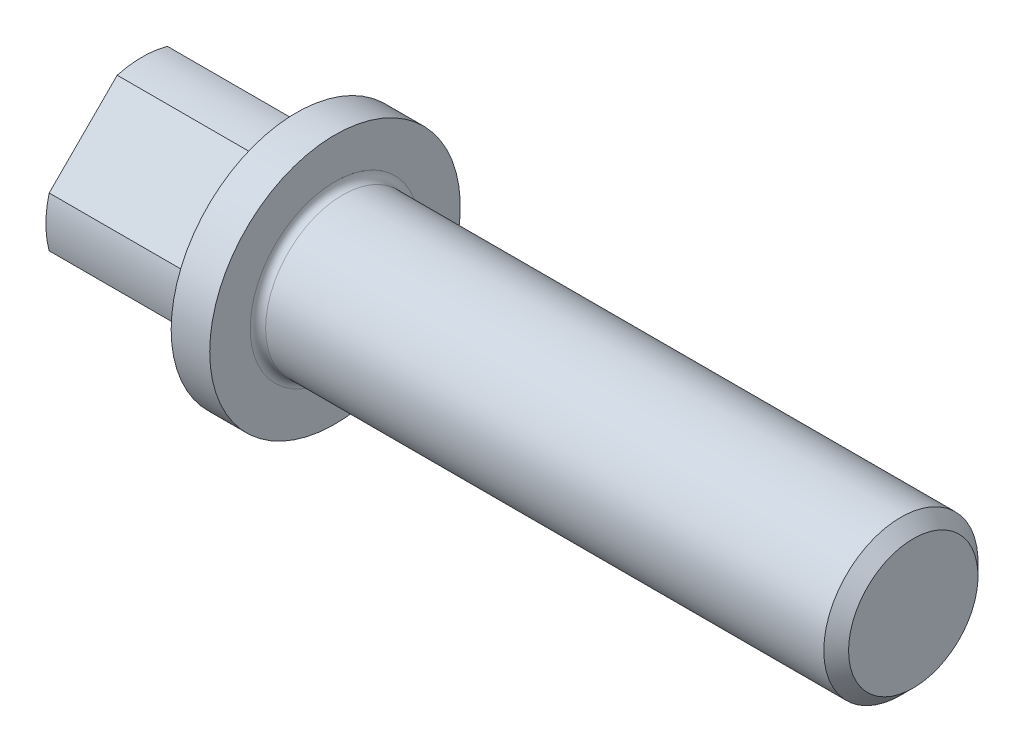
ISO-10303-21;
HEADER;
FILE_DESCRIPTION(('STEP AP214'),'2;1');
FILE_NAME('part.step','',(''),(''),'','','');
FILE_SCHEMA(('AUTOMOTIVE_DESIGN { 1 0 10303 214 1 1 1 1 }'));
ENDSEC;
DATA;
#1=APPLICATION_CONTEXT('core data for automotive mechanical design processes');
#2=APPLICATION_PROTOCOL_DEFINITION('international standard','automotive_design',2000,#1);
#3=PRODUCT_CONTEXT('',#1,'mechanical');
#4=PRODUCT('Part','Part','',(#3));
#5=PRODUCT_RELATED_PRODUCT_CATEGORY('part','',(#4));
#6=PRODUCT_DEFINITION_FORMATION('','',#4);
#7=PRODUCT_DEFINITION_CONTEXT('part definition',#1,'design');
#8=PRODUCT_DEFINITION('design','',#6,#7);
#9=PRODUCT_DEFINITION_SHAPE('','',#8);
#10=(LENGTH_UNIT() NAMED_UNIT(*) SI_UNIT(.MILLI.,.METRE.));
#11=(NAMED_UNIT(*) PLANE_ANGLE_UNIT() SI_UNIT($,.RADIAN.));
#12=(NAMED_UNIT(*) SI_UNIT($,.STERADIAN.) SOLID_ANGLE_UNIT());
#13=UNCERTAINTY_MEASURE_WITH_UNIT(LENGTH_MEASURE(1.E-05),#10,'distance_accuracy_value','');
#14=(GEOMETRIC_REPRESENTATION_CONTEXT(3) GLOBAL_UNCERTAINTY_ASSIGNED_CONTEXT((#13)) GLOBAL_UNIT_ASSIGNED_CONTEXT((#10,
#11,#12)) REPRESENTATION_CONTEXT('',''));
#15=CARTESIAN_POINT('',(0.,0.,0.));
#16=DIRECTION('',(0.,0.,1.));
#17=DIRECTION('',(1.,0.,0.));
#18=AXIS2_PLACEMENT_3D('',#15,#16,#17);
#19=CARTESIAN_POINT('',(60.,5.036,0.));
#20=DIRECTION('',(1.,0.,0.));
#21=DIRECTION('',(0.,0.,-1.));
#22=AXIS2_PLACEMENT_3D('',#19,#20,#21);
#23=PLANE('',#22);
#24=CARTESIAN_POINT('',(60.,0.,0.));
#25=DIRECTION('',(-1.,0.,0.));
#26=DIRECTION('',(0.,0.,1.));
#27=AXIS2_PLACEMENT_3D('',#24,#25,#26);
#28=CIRCLE('',#27,5.036);
#29=CARTESIAN_POINT('',(60.,0.,5.036));
#30=VERTEX_POINT('',#29);
#31=EDGE_CURVE('E171',#30,#30,#28,.T.);
#32=ORIENTED_EDGE('',*,*,#31,.F.);
#33=EDGE_LOOP('',(#32));
#34=FACE_BOUND('',#33,.T.);
#35=ADVANCED_FACE('F34',(#34),#23,.T.);
#36=CARTESIAN_POINT('',(60.,0.,0.));
#37=DIRECTION('',(-1.,0.,0.));
#38=DIRECTION('',(0.,0.,1.));
#39=AXIS2_PLACEMENT_3D('',#36,#37,#38);
#40=CONICAL_SURFACE('',#39,5.036,0.785398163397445);
#41=CARTESIAN_POINT('',(59.036,0.,0.));
#42=DIRECTION('',(-1.,0.,0.));
#43=DIRECTION('',(0.,0.,1.));
#44=AXIS2_PLACEMENT_3D('',#41,#42,#43);
#45=CIRCLE('',#44,6.);
#46=CARTESIAN_POINT('',(59.036,0.,6.));
#47=VERTEX_POINT('',#46);
#48=EDGE_CURVE('E168',#47,#47,#45,.T.);
#49=ORIENTED_EDGE('',*,*,#48,.F.);
#50=EDGE_LOOP('',(#49));
#51=FACE_BOUND('',#50,.T.);
#52=ORIENTED_EDGE('',*,*,#31,.T.);
#53=EDGE_LOOP('',(#52));
#54=FACE_BOUND('',#53,.T.);
#55=ADVANCED_FACE('F193',(#51,#54),#40,.T.);
#56=CARTESIAN_POINT('',(-31.75,0.,0.));
#57=DIRECTION('',(-1.,0.,0.));
#58=DIRECTION('',(0.,0.,1.));
#59=AXIS2_PLACEMENT_3D('',#56,#57,#58);
#60=CYLINDRICAL_SURFACE('',#59,6.);
#61=CARTESIAN_POINT('',(15.6,0.,0.));
#62=DIRECTION('',(1.,0.,0.));
#63=DIRECTION('',(0.,0.,-1.));
#64=AXIS2_PLACEMENT_3D('',#61,#62,#63);
#65=CIRCLE('',#64,6.);
#66=CARTESIAN_POINT('',(15.6,0.,-6.));
#67=VERTEX_POINT('',#66);
#68=EDGE_CURVE('E12',#67,#67,#65,.T.);
#69=ORIENTED_EDGE('',*,*,#68,.T.);
#70=EDGE_LOOP('',(#69));
#71=FACE_BOUND('',#70,.T.);
#72=ORIENTED_EDGE('',*,*,#48,.T.);
#73=EDGE_LOOP('',(#72));
#74=FACE_BOUND('',#73,.T.);
#75=ADVANCED_FACE('F198',(#71,#74),#60,.T.);
#76=CARTESIAN_POINT('',(15.,9.75,0.));
#77=DIRECTION('',(1.,0.,0.));
#78=DIRECTION('',(0.,0.,-1.));
#79=AXIS2_PLACEMENT_3D('',#76,#77,#78);
#80=PLANE('',#79);
#81=CARTESIAN_POINT('',(15.,0.,0.));
#82=DIRECTION('',(1.,0.,0.));
#83=DIRECTION('',(0.,0.,-1.));
#84=AXIS2_PLACEMENT_3D('',#81,#82,#83);
#85=CIRCLE('',#84,6.6);
#86=CARTESIAN_POINT('',(15.,0.,-6.6));
#87=VERTEX_POINT('',#86);
#88=EDGE_CURVE('E43',#87,#87,#85,.F.);
#89=ORIENTED_EDGE('',*,*,#88,.T.);
#90=EDGE_LOOP('',(#89));
#91=FACE_BOUND('',#90,.T.);
#92=CARTESIAN_POINT('',(15.,0.,0.));
#93=DIRECTION('',(-1.,0.,0.));
#94=DIRECTION('',(0.,0.,1.));
#95=AXIS2_PLACEMENT_3D('',#92,#93,#94);
#96=CIRCLE('',#95,9.75);
#97=CARTESIAN_POINT('',(15.,0.,9.75));
#98=VERTEX_POINT('',#97);
#99=EDGE_CURVE('E165',#98,#98,#96,.T.);
#100=ORIENTED_EDGE('',*,*,#99,.F.);
#101=EDGE_LOOP('',(#100));
#102=FACE_BOUND('',#101,.T.);
#103=ADVANCED_FACE('F177',(#91,#102),#80,.T.);
#104=CARTESIAN_POINT('',(-31.75,0.,0.));
#105=DIRECTION('',(-1.,0.,0.));
#106=DIRECTION('',(0.,0.,1.));
#107=AXIS2_PLACEMENT_3D('',#104,#105,#106);
#108=CYLINDRICAL_SURFACE('',#107,9.75);
#109=CARTESIAN_POINT('',(12.,0.,0.));
#110=DIRECTION('',(1.,0.,0.));
#111=DIRECTION('',(0.,0.,-1.));
#112=AXIS2_PLACEMENT_3D('',#109,#110,#111);
#113=CIRCLE('',#112,9.75);
#114=CARTESIAN_POINT('',(12.,0.,-9.75));
#115=VERTEX_POINT('',#114);
#116=EDGE_CURVE('E38',#115,#115,#113,.F.);
#117=ORIENTED_EDGE('',*,*,#116,.F.);
#118=EDGE_LOOP('',(#117));
#119=FACE_BOUND('',#118,.T.);
#120=ORIENTED_EDGE('',*,*,#99,.T.);
#121=EDGE_LOOP('',(#120));
#122=FACE_BOUND('',#121,.T.);
#123=ADVANCED_FACE('F181',(#119,#122),#108,.T.);
#124=CARTESIAN_POINT('',(15.6,0.,0.));
#125=DIRECTION('',(1.,0.,0.));
#126=DIRECTION('',(0.,0.,-1.));
#127=AXIS2_PLACEMENT_3D('',#124,#125,#126);
#128=TOROIDAL_SURFACE('',#127,6.6,0.6);
#129=ORIENTED_EDGE('',*,*,#68,.F.);
#130=EDGE_LOOP('',(#129));
#131=FACE_BOUND('',#130,.T.);
#132=ORIENTED_EDGE('',*,*,#88,.F.);
#133=EDGE_LOOP('',(#132));
#134=FACE_BOUND('',#133,.T.);
#135=ADVANCED_FACE('F36',(#131,#134),#128,.F.);
#136=CARTESIAN_POINT('',(12.,0.,0.));
#137=DIRECTION('',(1.,0.,0.));
#138=DIRECTION('',(0.,0.,-1.));
#139=AXIS2_PLACEMENT_3D('',#136,#137,#138);
#140=PLANE('',#139);
#141=ORIENTED_EDGE('',*,*,#116,.T.);
#142=EDGE_LOOP('',(#141));
#143=FACE_BOUND('',#142,.T.);
#144=DIRECTION('',(0.,-0.707106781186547,-0.707106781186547));
#145=VECTOR('',#144,1.);
#146=CARTESIAN_POINT('',(12.,-7.24194538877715,1.95044276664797));
#147=LINE('',#146,#145);
#148=CARTESIAN_POINT('',(12.,-1.95044276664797,7.24194538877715));
#149=VERTEX_POINT('',#148);
#150=CARTESIAN_POINT('',(12.,-7.24194538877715,1.95044276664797));
#151=VERTEX_POINT('',#150);
#152=EDGE_CURVE('E102',#149,#151,#147,.T.);
#153=ORIENTED_EDGE('',*,*,#152,.T.);
#154=CARTESIAN_POINT('',(12.,0.,0.));
#155=DIRECTION('',(1.,0.,0.));
#156=DIRECTION('',(0.,0.,-1.));
#157=AXIS2_PLACEMENT_3D('',#154,#155,#156);
#158=CIRCLE('',#157,7.5);
#159=CARTESIAN_POINT('',(12.,-7.24194538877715,-1.95044276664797));
#160=VERTEX_POINT('',#159);
#161=EDGE_CURVE('E122',#151,#160,#158,.T.);
#162=ORIENTED_EDGE('',*,*,#161,.T.);
#163=DIRECTION('',(0.,0.707106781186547,-0.707106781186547));
#164=VECTOR('',#163,1.);
#165=CARTESIAN_POINT('',(12.,-7.24194538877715,-1.95044276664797));
#166=LINE('',#165,#164);
#167=CARTESIAN_POINT('',(12.,-1.95044276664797,-7.24194538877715));
#168=VERTEX_POINT('',#167);
#169=EDGE_CURVE('E124',#160,#168,#166,.T.);
#170=ORIENTED_EDGE('',*,*,#169,.T.);
#171=CARTESIAN_POINT('',(12.,0.,0.));
#172=DIRECTION('',(1.,0.,0.));
#173=DIRECTION('',(0.,0.,-1.));
#174=AXIS2_PLACEMENT_3D('',#171,#172,#173);
#175=CIRCLE('',#174,7.5);
#176=CARTESIAN_POINT('',(12.,1.95044276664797,-7.24194538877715));
#177=VERTEX_POINT('',#176);
#178=EDGE_CURVE('E128',#168,#177,#175,.T.);
#179=ORIENTED_EDGE('',*,*,#178,.T.);
#180=DIRECTION('',(0.,0.707106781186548,0.707106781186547));
#181=VECTOR('',#180,1.);
#182=CARTESIAN_POINT('',(12.,1.95044276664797,-7.24194538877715));
#183=LINE('',#182,#181);
#184=CARTESIAN_POINT('',(12.,7.24194538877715,-1.95044276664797));
#185=VERTEX_POINT('',#184);
#186=EDGE_CURVE('E130',#177,#185,#183,.T.);
#187=ORIENTED_EDGE('',*,*,#186,.T.);
#188=CARTESIAN_POINT('',(12.,0.,0.));
#189=DIRECTION('',(1.,0.,0.));
#190=DIRECTION('',(0.,0.,-1.));
#191=AXIS2_PLACEMENT_3D('',#188,#189,#190);
#192=CIRCLE('',#191,7.5);
#193=CARTESIAN_POINT('',(12.,7.24194538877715,1.95044276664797));
#194=VERTEX_POINT('',#193);
#195=EDGE_CURVE('E132',#185,#194,#192,.T.);
#196=ORIENTED_EDGE('',*,*,#195,.T.);
#197=DIRECTION('',(0.,-0.707106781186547,0.707106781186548));
#198=VECTOR('',#197,1.);
#199=CARTESIAN_POINT('',(12.,1.95044276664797,7.24194538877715));
#200=LINE('',#199,#198);
#201=CARTESIAN_POINT('',(12.,1.95044276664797,7.24194538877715));
#202=VERTEX_POINT('',#201);
#203=EDGE_CURVE('E105',#194,#202,#200,.T.);
#204=ORIENTED_EDGE('',*,*,#203,.T.);
#205=CARTESIAN_POINT('',(12.,0.,0.));
#206=DIRECTION('',(1.,0.,0.));
#207=DIRECTION('',(0.,0.,-1.));
#208=AXIS2_PLACEMENT_3D('',#205,#206,#207);
#209=CIRCLE('',#208,7.5);
#210=EDGE_CURVE('E98',#202,#149,#209,.T.);
#211=ORIENTED_EDGE('',*,*,#210,.T.);
#212=EDGE_LOOP('',(#153,#162,#170,#179,#187,#196,#204,#211));
#213=FACE_BOUND('',#212,.T.);
#214=ADVANCED_FACE('F100',(#143,#213),#140,.F.);
#215=CARTESIAN_POINT('',(12.,0.,0.));
#216=DIRECTION('',(-1.,0.,0.));
#217=DIRECTION('',(0.,0.,1.));
#218=AXIS2_PLACEMENT_3D('',#215,#216,#217);
#219=CYLINDRICAL_SURFACE('',#218,7.5);
#220=CARTESIAN_POINT('',(0.,0.,0.));
#221=DIRECTION('',(1.,0.,0.));
#222=DIRECTION('',(0.,0.,-1.));
#223=AXIS2_PLACEMENT_3D('',#220,#221,#222);
#224=CIRCLE('',#223,7.5);
#225=CARTESIAN_POINT('',(0.,1.95044276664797,7.24194538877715));
#226=VERTEX_POINT('',#225);
#227=CARTESIAN_POINT('',(0.,-1.95044276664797,7.24194538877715));
#228=VERTEX_POINT('',#227);
#229=EDGE_CURVE('E114',#226,#228,#224,.T.);
#230=ORIENTED_EDGE('',*,*,#229,.T.);
#231=DIRECTION('',(-1.,0.,0.));
#232=VECTOR('',#231,1.);
#233=CARTESIAN_POINT('',(12.,-1.95044276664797,7.24194538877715));
#234=LINE('',#233,#232);
#235=EDGE_CURVE('E111',#149,#228,#234,.T.);
#236=ORIENTED_EDGE('',*,*,#235,.F.);
#237=ORIENTED_EDGE('',*,*,#210,.F.);
#238=DIRECTION('',(-1.,0.,0.));
#239=VECTOR('',#238,1.);
#240=CARTESIAN_POINT('',(12.,1.95044276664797,7.24194538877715));
#241=LINE('',#240,#239);
#242=EDGE_CURVE('E135',#202,#226,#241,.T.);
#243=ORIENTED_EDGE('',*,*,#242,.T.);
#244=EDGE_LOOP('',(#230,#236,#237,#243));
#245=FACE_BOUND('',#244,.T.);
#246=ADVANCED_FACE('F112',(#245),#219,.T.);
#247=CARTESIAN_POINT('',(12.,-7.24194538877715,1.95044276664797));
#248=DIRECTION('',(0.,0.707106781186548,-0.707106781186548));
#249=DIRECTION('',(0.,0.707106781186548,0.707106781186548));
#250=AXIS2_PLACEMENT_3D('',#247,#248,#249);
#251=PLANE('',#250);
#252=DIRECTION('',(0.,-0.707106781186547,-0.707106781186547));
#253=VECTOR('',#252,1.);
#254=CARTESIAN_POINT('',(0.,-7.24194538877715,1.95044276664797));
#255=LINE('',#254,#253);
#256=CARTESIAN_POINT('',(0.,-7.24194538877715,1.95044276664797));
#257=VERTEX_POINT('',#256);
#258=EDGE_CURVE('E137',#228,#257,#255,.T.);
#259=ORIENTED_EDGE('',*,*,#258,.T.);
#260=DIRECTION('',(-1.,0.,0.));
#261=VECTOR('',#260,1.);
#262=CARTESIAN_POINT('',(12.,-7.24194538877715,1.95044276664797));
#263=LINE('',#262,#261);
#264=EDGE_CURVE('E118',#151,#257,#263,.T.);
#265=ORIENTED_EDGE('',*,*,#264,.F.);
#266=ORIENTED_EDGE('',*,*,#152,.F.);
#267=ORIENTED_EDGE('',*,*,#235,.T.);
#268=EDGE_LOOP('',(#259,#265,#266,#267));
#269=FACE_BOUND('',#268,.T.);
#270=ADVANCED_FACE('F120',(#269),#251,.F.);
#271=CARTESIAN_POINT('',(12.,0.,0.));
#272=DIRECTION('',(-1.,0.,0.));
#273=DIRECTION('',(0.,0.,1.));
#274=AXIS2_PLACEMENT_3D('',#271,#272,#273);
#275=CYLINDRICAL_SURFACE('',#274,7.5);
#276=CARTESIAN_POINT('',(0.,0.,0.));
#277=DIRECTION('',(1.,0.,0.));
#278=DIRECTION('',(0.,0.,-1.));
#279=AXIS2_PLACEMENT_3D('',#276,#277,#278);
#280=CIRCLE('',#279,7.5);
#281=CARTESIAN_POINT('',(0.,-7.24194538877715,-1.95044276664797));
#282=VERTEX_POINT('',#281);
#283=EDGE_CURVE('E139',#257,#282,#280,.T.);
#284=ORIENTED_EDGE('',*,*,#283,.T.);
#285=DIRECTION('',(-1.,0.,0.));
#286=VECTOR('',#285,1.);
#287=CARTESIAN_POINT('',(12.,-7.24194538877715,-1.95044276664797));
#288=LINE('',#287,#286);
#289=EDGE_CURVE('E162',#160,#282,#288,.T.);
#290=ORIENTED_EDGE('',*,*,#289,.F.);
#291=ORIENTED_EDGE('',*,*,#161,.F.);
#292=ORIENTED_EDGE('',*,*,#264,.T.);
#293=EDGE_LOOP('',(#284,#290,#291,#292));
#294=FACE_BOUND('',#293,.T.);
#295=ADVANCED_FACE('F217',(#294),#275,.T.);
#296=CARTESIAN_POINT('',(12.,-7.24194538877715,-1.95044276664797));
#297=DIRECTION('',(0.,0.707106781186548,0.707106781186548));
#298=DIRECTION('',(0.,-0.707106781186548,0.707106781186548));
#299=AXIS2_PLACEMENT_3D('',#296,#297,#298);
#300=PLANE('',#299);
#301=DIRECTION('',(0.,0.707106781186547,-0.707106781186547));
#302=VECTOR('',#301,1.);
#303=CARTESIAN_POINT('',(0.,-7.24194538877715,-1.95044276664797));
#304=LINE('',#303,#302);
#305=CARTESIAN_POINT('',(0.,-1.95044276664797,-7.24194538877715));
#306=VERTEX_POINT('',#305);
#307=EDGE_CURVE('E142',#282,#306,#304,.T.);
#308=ORIENTED_EDGE('',*,*,#307,.T.);
#309=DIRECTION('',(-1.,0.,0.));
#310=VECTOR('',#309,1.);
#311=CARTESIAN_POINT('',(12.,-1.95044276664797,-7.24194538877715));
#312=LINE('',#311,#310);
#313=EDGE_CURVE('E160',#168,#306,#312,.T.);
#314=ORIENTED_EDGE('',*,*,#313,.F.);
#315=ORIENTED_EDGE('',*,*,#169,.F.);
#316=ORIENTED_EDGE('',*,*,#289,.T.);
#317=EDGE_LOOP('',(#308,#314,#315,#316));
#318=FACE_BOUND('',#317,.T.);
#319=ADVANCED_FACE('F220',(#318),#300,.F.);
#320=CARTESIAN_POINT('',(12.,0.,0.));
#321=DIRECTION('',(-1.,0.,0.));
#322=DIRECTION('',(0.,0.,1.));
#323=AXIS2_PLACEMENT_3D('',#320,#321,#322);
#324=CYLINDRICAL_SURFACE('',#323,7.5);
#325=CARTESIAN_POINT('',(0.,0.,0.));
#326=DIRECTION('',(1.,0.,0.));
#327=DIRECTION('',(0.,0.,-1.));
#328=AXIS2_PLACEMENT_3D('',#325,#326,#327);
#329=CIRCLE('',#328,7.5);
#330=CARTESIAN_POINT('',(0.,1.95044276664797,-7.24194538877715));
#331=VERTEX_POINT('',#330);
#332=EDGE_CURVE('E145',#306,#331,#329,.T.);
#333=ORIENTED_EDGE('',*,*,#332,.T.);
#334=DIRECTION('',(-1.,0.,0.));
#335=VECTOR('',#334,1.);
#336=CARTESIAN_POINT('',(12.,1.95044276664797,-7.24194538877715));
#337=LINE('',#336,#335);
#338=EDGE_CURVE('E158',#177,#331,#337,.T.);
#339=ORIENTED_EDGE('',*,*,#338,.F.);
#340=ORIENTED_EDGE('',*,*,#178,.F.);
#341=ORIENTED_EDGE('',*,*,#313,.T.);
#342=EDGE_LOOP('',(#333,#339,#340,#341));
#343=FACE_BOUND('',#342,.T.);
#344=ADVANCED_FACE('F224',(#343),#324,.T.);
#345=CARTESIAN_POINT('',(12.,1.95044276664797,-7.24194538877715));
#346=DIRECTION('',(0.,-0.707106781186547,0.707106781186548));
#347=DIRECTION('',(0.,-0.707106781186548,-0.707106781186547));
#348=AXIS2_PLACEMENT_3D('',#345,#346,#347);
#349=PLANE('',#348);
#350=DIRECTION('',(0.,0.707106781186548,0.707106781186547));
#351=VECTOR('',#350,1.);
#352=CARTESIAN_POINT('',(0.,1.95044276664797,-7.24194538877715));
#353=LINE('',#352,#351);
#354=CARTESIAN_POINT('',(0.,7.24194538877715,-1.95044276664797));
#355=VERTEX_POINT('',#354);
#356=EDGE_CURVE('E148',#331,#355,#353,.T.);
#357=ORIENTED_EDGE('',*,*,#356,.T.);
#358=DIRECTION('',(-1.,0.,0.));
#359=VECTOR('',#358,1.);
#360=CARTESIAN_POINT('',(12.,7.24194538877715,-1.95044276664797));
#361=LINE('',#360,#359);
#362=EDGE_CURVE('E156',#185,#355,#361,.T.);
#363=ORIENTED_EDGE('',*,*,#362,.F.);
#364=ORIENTED_EDGE('',*,*,#186,.F.);
#365=ORIENTED_EDGE('',*,*,#338,.T.);
#366=EDGE_LOOP('',(#357,#363,#364,#365));
#367=FACE_BOUND('',#366,.T.);
#368=ADVANCED_FACE('F228',(#367),#349,.F.);
#369=CARTESIAN_POINT('',(12.,0.,0.));
#370=DIRECTION('',(-1.,0.,0.));
#371=DIRECTION('',(0.,0.,1.));
#372=AXIS2_PLACEMENT_3D('',#369,#370,#371);
#373=CYLINDRICAL_SURFACE('',#372,7.5);
#374=CARTESIAN_POINT('',(0.,0.,0.));
#375=DIRECTION('',(1.,0.,0.));
#376=DIRECTION('',(0.,0.,-1.));
#377=AXIS2_PLACEMENT_3D('',#374,#375,#376);
#378=CIRCLE('',#377,7.5);
#379=CARTESIAN_POINT('',(0.,7.24194538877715,1.95044276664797));
#380=VERTEX_POINT('',#379);
#381=EDGE_CURVE('E50',#355,#380,#378,.T.);
#382=ORIENTED_EDGE('',*,*,#381,.T.);
#383=DIRECTION('',(-1.,0.,0.));
#384=VECTOR('',#383,1.);
#385=CARTESIAN_POINT('',(12.,7.24194538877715,1.95044276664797));
#386=LINE('',#385,#384);
#387=EDGE_CURVE('E54',#194,#380,#386,.T.);
#388=ORIENTED_EDGE('',*,*,#387,.F.);
#389=ORIENTED_EDGE('',*,*,#195,.F.);
#390=ORIENTED_EDGE('',*,*,#362,.T.);
#391=EDGE_LOOP('',(#382,#388,#389,#390));
#392=FACE_BOUND('',#391,.T.);
#393=ADVANCED_FACE('F232',(#392),#373,.T.);
#394=CARTESIAN_POINT('',(12.,1.95044276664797,7.24194538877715));
#395=DIRECTION('',(0.,-0.707106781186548,-0.707106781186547));
#396=DIRECTION('',(0.,0.707106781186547,-0.707106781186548));
#397=AXIS2_PLACEMENT_3D('',#394,#395,#396);
#398=PLANE('',#397);
#399=DIRECTION('',(0.,-0.707106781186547,0.707106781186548));
#400=VECTOR('',#399,1.);
#401=CARTESIAN_POINT('',(0.,1.95044276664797,7.24194538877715));
#402=LINE('',#401,#400);
#403=EDGE_CURVE('E108',#380,#226,#402,.T.);
#404=ORIENTED_EDGE('',*,*,#403,.T.);
#405=ORIENTED_EDGE('',*,*,#242,.F.);
#406=ORIENTED_EDGE('',*,*,#203,.F.);
#407=ORIENTED_EDGE('',*,*,#387,.T.);
#408=EDGE_LOOP('',(#404,#405,#406,#407));
#409=FACE_BOUND('',#408,.T.);
#410=ADVANCED_FACE('F210',(#409),#398,.F.);
#411=CARTESIAN_POINT('',(0.,0.,0.));
#412=DIRECTION('',(-1.,0.,0.));
#413=DIRECTION('',(0.,0.,1.));
#414=AXIS2_PLACEMENT_3D('',#411,#412,#413);
#415=PLANE('',#414);
#416=ORIENTED_EDGE('',*,*,#229,.F.);
#417=ORIENTED_EDGE('',*,*,#403,.F.);
#418=ORIENTED_EDGE('',*,*,#381,.F.);
#419=ORIENTED_EDGE('',*,*,#356,.F.);
#420=ORIENTED_EDGE('',*,*,#332,.F.);
#421=ORIENTED_EDGE('',*,*,#307,.F.);
#422=ORIENTED_EDGE('',*,*,#283,.F.);
#423=ORIENTED_EDGE('',*,*,#258,.F.);
#424=EDGE_LOOP('',(#416,#417,#418,#419,#420,#421,#422,#423));
#425=FACE_BOUND('',#424,.T.);
#426=ADVANCED_FACE('F208',(#425),#415,.T.);
#427=CLOSED_SHELL('',(#35,#55,#75,#103,#123,#135,#214,#246,#270,#295,#319,#344,#368,#393,#410,#426));
#428=MANIFOLD_SOLID_BREP('B2',#427);
#429=ADVANCED_BREP_SHAPE_REPRESENTATION('',(#18,#428),#14);
#430=SHAPE_DEFINITION_REPRESENTATION(#9,#429);
ENDSEC;
END-ISO-10303-21;
